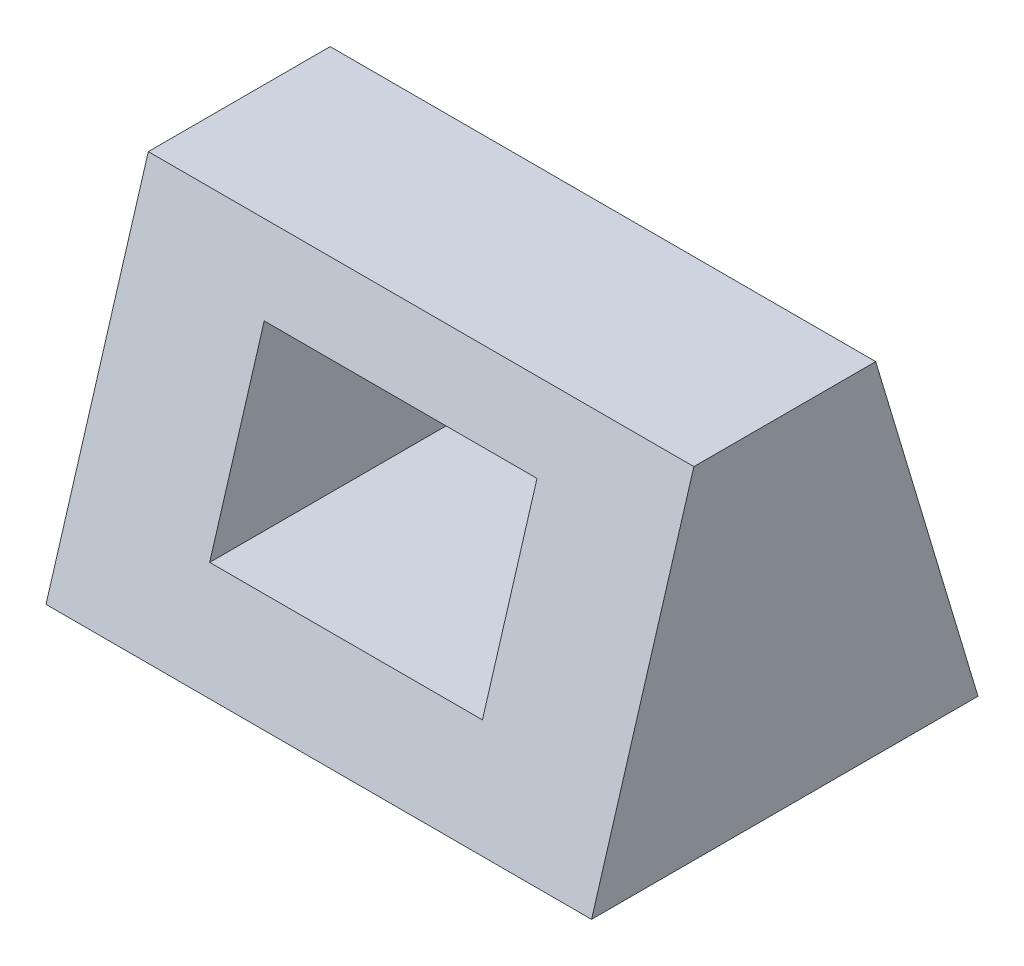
from build123d import *

# Parameters (mm, degrees)
EXTRUDE_1_DEPTH          = 120
CUT_EXTRUDE_3_DEPTH      = 98
CUT_EXTRUDE_3_DEPTH_BACK = 148.754018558
SKETCH_6_W               = 60
SKETCH_6_H               = 40


with BuildPart() as part:
    # Sketch 1 → Extrude 1 (new body)
    with BuildSketch(Plane(origin=(0, 0, 0), x_dir=(0, 0, -1), z_dir=(1, 0, 0))):
        Polygon((-42.5, 0), (42.5, 0), (20, 75), (-20, 75), align=None)
    extrude(amount=EXTRUDE_1_DEPTH)

    # Sketch 6 → Cut-Extrude 3 (cut, two sides: drawn at the far end of the back side and taken through both)
    with BuildSketch(Plane.XY.offset(-CUT_EXTRUDE_3_DEPTH_BACK)):
        with Locations((60, 40)):
            Rectangle(SKETCH_6_W, SKETCH_6_H)
    extrude(amount=CUT_EXTRUDE_3_DEPTH + CUT_EXTRUDE_3_DEPTH_BACK, mode=Mode.SUBTRACT)


solid = part.part
